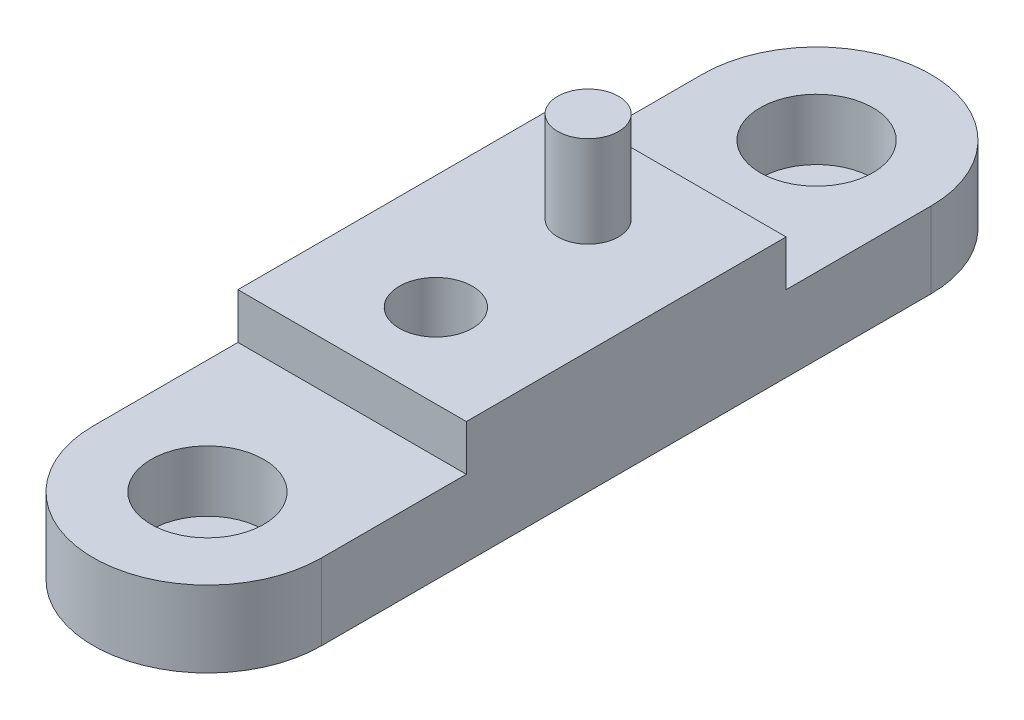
from build123d import *

# Parameters (mm, degrees)
BOSS_EXTRUDE1_DEPTH = 4
CUT_EXTRUDE1_START  = -1.5
CUT_EXTRUDE1_DEPTH  = 1.5
SKETCH3_R           = 1.85
CUT_EXTRUDE2_DEPTH  = 2
SKETCH4_R           = 1
BOSS_EXTRUDE2_DEPTH = 3
SKETCH5_R           = 1.2
CUT_EXTRUDE3_DEPTH  = 4


with BuildPart() as part:
    # Sketch1 → Boss-Extrude1 (new body)
    with BuildSketch(Plane(origin=(0, 0, 0), x_dir=(1, 0, 0), z_dir=(0, 1, 0))):
        with BuildLine():
            Line((-3.75, -10), (3.75, -10))
            Line((3.75, -10), (3.75, 0))
            ThreePointArc((3.75, 0), (0, 3.75), (-3.75, 0))
            Line((-3.75, 0), (-3.75, -10))
        make_face()
    extrude(amount=BOSS_EXTRUDE1_DEPTH)

    # Sketch2 → Cut-Extrude1 (cut)
    with BuildSketch(Plane(origin=(0, 4, 0), x_dir=(1, 0, 0), z_dir=(0, 1, 0)).offset(CUT_EXTRUDE1_START)):
        with BuildLine():
            Line((-3.75, -4.75), (3.75, -4.75))
            Line((3.75, -4.75), (3.75, 0))
            ThreePointArc((3.75, 0), (0, 3.75), (-3.75, 0))
            Line((-3.75, 0), (-3.75, -4.75))
        make_face()
    extrude(amount=CUT_EXTRUDE1_DEPTH, mode=Mode.SUBTRACT)

    # Sketch3 → Cut-Extrude2 (cut)
    with BuildSketch(Plane(origin=(0, 2.5, 0), x_dir=(1, 0, 0), z_dir=(0, 1, 0))):
        with Locations(Location((0, 0, 0), (0, 0, 270))):
            Circle(SKETCH3_R)
    extrude(amount=-CUT_EXTRUDE2_DEPTH, mode=Mode.SUBTRACT)

    # Mirror1: part across plane


with BuildPart() as part_1:
    add(part.part)
    add(part.part.mirror(Plane(origin=(-3.75, 4, 10), x_dir=(1, 0, 0), z_dir=(0, 0, -1))))

    # Sketch4 → Boss-Extrude2 (add)
    with BuildSketch(Plane(origin=(0, 4, 0), x_dir=(1, 0, 0), z_dir=(0, 1, 0))):
        with Locations(Location((0, -7.5, 0), (0, 0, 270))):
            Circle(SKETCH4_R)
    extrude(amount=BOSS_EXTRUDE2_DEPTH)

    # Sketch5 → Cut-Extrude3 (cut)
    with BuildSketch(Plane(origin=(0, 4, 0), x_dir=(1, 0, 0), z_dir=(0, 1, 0))):
        with Locations(Location((0, -12.5, 0), (0, 0, 270))):
            Circle(SKETCH5_R)
    extrude(amount=-CUT_EXTRUDE3_DEPTH, mode=Mode.SUBTRACT)


solid = part_1.part
